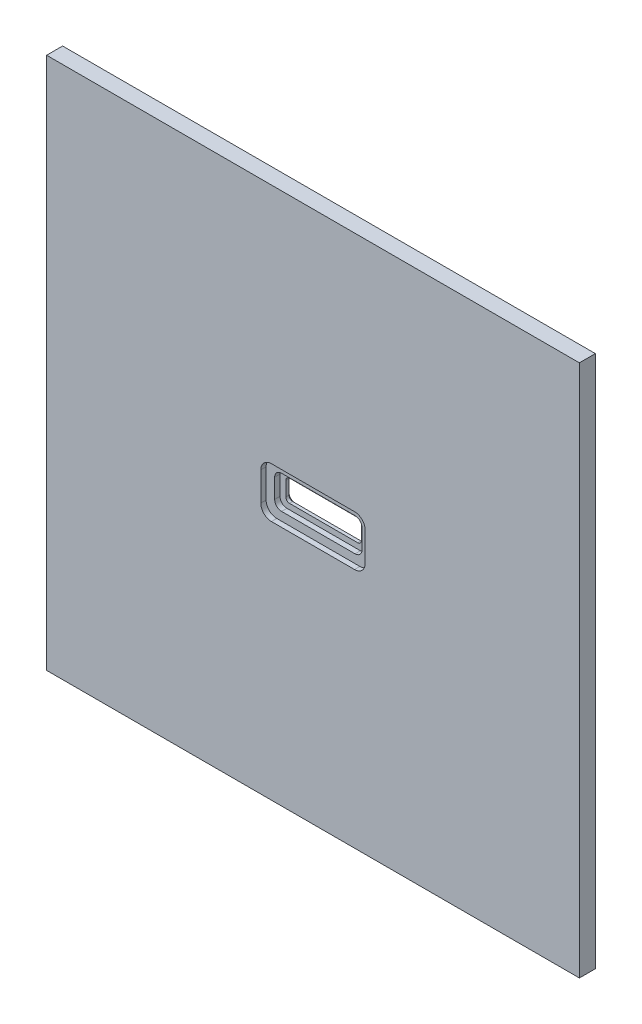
ISO-10303-21;
HEADER;
FILE_DESCRIPTION(('STEP AP214'),'2;1');
FILE_NAME('part.step','',(''),(''),'','','');
FILE_SCHEMA(('AUTOMOTIVE_DESIGN { 1 0 10303 214 1 1 1 1 }'));
ENDSEC;
DATA;
#1=APPLICATION_CONTEXT('core data for automotive mechanical design processes');
#2=APPLICATION_PROTOCOL_DEFINITION('international standard','automotive_design',2000,#1);
#3=PRODUCT_CONTEXT('',#1,'mechanical');
#4=PRODUCT('Part','Part','',(#3));
#5=PRODUCT_RELATED_PRODUCT_CATEGORY('part','',(#4));
#6=PRODUCT_DEFINITION_FORMATION('','',#4);
#7=PRODUCT_DEFINITION_CONTEXT('part definition',#1,'design');
#8=PRODUCT_DEFINITION('design','',#6,#7);
#9=PRODUCT_DEFINITION_SHAPE('','',#8);
#10=(LENGTH_UNIT() NAMED_UNIT(*) SI_UNIT(.MILLI.,.METRE.));
#11=(NAMED_UNIT(*) PLANE_ANGLE_UNIT() SI_UNIT($,.RADIAN.));
#12=(NAMED_UNIT(*) SI_UNIT($,.STERADIAN.) SOLID_ANGLE_UNIT());
#13=UNCERTAINTY_MEASURE_WITH_UNIT(LENGTH_MEASURE(1.E-05),#10,'distance_accuracy_value','');
#14=(GEOMETRIC_REPRESENTATION_CONTEXT(3) GLOBAL_UNCERTAINTY_ASSIGNED_CONTEXT((#13)) GLOBAL_UNIT_ASSIGNED_CONTEXT((#10,
#11,#12)) REPRESENTATION_CONTEXT('',''));
#15=CARTESIAN_POINT('',(0.,0.,0.));
#16=DIRECTION('',(0.,0.,1.));
#17=DIRECTION('',(1.,0.,0.));
#18=AXIS2_PLACEMENT_3D('',#15,#16,#17);
#19=CARTESIAN_POINT('',(0.,0.,1.5));
#20=DIRECTION('',(0.,0.,-1.));
#21=DIRECTION('',(-1.,0.,0.));
#22=AXIS2_PLACEMENT_3D('',#19,#20,#21);
#23=PLANE('',#22);
#24=DIRECTION('',(0.,1.,0.));
#25=VECTOR('',#24,1.);
#26=CARTESIAN_POINT('',(25.,-25.,1.5));
#27=LINE('',#26,#25);
#28=CARTESIAN_POINT('',(25.,-25.,1.5));
#29=VERTEX_POINT('',#28);
#30=CARTESIAN_POINT('',(25.,25.,1.5));
#31=VERTEX_POINT('',#30);
#32=EDGE_CURVE('E495',#29,#31,#27,.T.);
#33=ORIENTED_EDGE('',*,*,#32,.T.);
#34=DIRECTION('',(-1.,0.,0.));
#35=VECTOR('',#34,1.);
#36=CARTESIAN_POINT('',(-25.,25.,1.5));
#37=LINE('',#36,#35);
#38=CARTESIAN_POINT('',(-25.,25.,1.5));
#39=VERTEX_POINT('',#38);
#40=EDGE_CURVE('E499',#31,#39,#37,.T.);
#41=ORIENTED_EDGE('',*,*,#40,.T.);
#42=DIRECTION('',(0.,-1.,0.));
#43=VECTOR('',#42,1.);
#44=CARTESIAN_POINT('',(-25.,-25.,1.5));
#45=LINE('',#44,#43);
#46=CARTESIAN_POINT('',(-25.,-25.,1.5));
#47=VERTEX_POINT('',#46);
#48=EDGE_CURVE('E503',#39,#47,#45,.T.);
#49=ORIENTED_EDGE('',*,*,#48,.T.);
#50=DIRECTION('',(1.,0.,0.));
#51=VECTOR('',#50,1.);
#52=CARTESIAN_POINT('',(-25.,-25.,1.5));
#53=LINE('',#52,#51);
#54=EDGE_CURVE('E506',#47,#29,#53,.T.);
#55=ORIENTED_EDGE('',*,*,#54,.T.);
#56=EDGE_LOOP('',(#33,#41,#49,#55));
#57=FACE_BOUND('',#56,.T.);
#58=CARTESIAN_POINT('',(-3.9,1.35,1.5));
#59=DIRECTION('',(0.,0.,1.));
#60=DIRECTION('',(1.,0.,0.));
#61=AXIS2_PLACEMENT_3D('',#58,#59,#60);
#62=CIRCLE('',#61,1.);
#63=CARTESIAN_POINT('',(-4.9,1.34999999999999,1.5));
#64=VERTEX_POINT('',#63);
#65=CARTESIAN_POINT('',(-3.89999999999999,2.35,1.5));
#66=VERTEX_POINT('',#65);
#67=EDGE_CURVE('E273',#64,#66,#62,.F.);
#68=ORIENTED_EDGE('',*,*,#67,.T.);
#69=DIRECTION('',(1.,0.,0.));
#70=VECTOR('',#69,1.);
#71=CARTESIAN_POINT('',(0.,2.35,1.5));
#72=LINE('',#71,#70);
#73=CARTESIAN_POINT('',(3.89999999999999,2.35,1.5));
#74=VERTEX_POINT('',#73);
#75=EDGE_CURVE('E282',#66,#74,#72,.T.);
#76=ORIENTED_EDGE('',*,*,#75,.T.);
#77=CARTESIAN_POINT('',(3.9,1.35,1.5));
#78=DIRECTION('',(0.,0.,1.));
#79=DIRECTION('',(1.,0.,0.));
#80=AXIS2_PLACEMENT_3D('',#77,#78,#79);
#81=CIRCLE('',#80,1.);
#82=CARTESIAN_POINT('',(4.9,1.34999999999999,1.5));
#83=VERTEX_POINT('',#82);
#84=EDGE_CURVE('E286',#74,#83,#81,.F.);
#85=ORIENTED_EDGE('',*,*,#84,.T.);
#86=DIRECTION('',(0.,1.,0.));
#87=VECTOR('',#86,1.);
#88=CARTESIAN_POINT('',(4.9,0.,1.5));
#89=LINE('',#88,#87);
#90=CARTESIAN_POINT('',(4.9,-1.34999999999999,1.5));
#91=VERTEX_POINT('',#90);
#92=EDGE_CURVE('E351',#91,#83,#89,.T.);
#93=ORIENTED_EDGE('',*,*,#92,.F.);
#94=CARTESIAN_POINT('',(3.9,-1.35,1.5));
#95=DIRECTION('',(0.,0.,1.));
#96=DIRECTION('',(1.,0.,0.));
#97=AXIS2_PLACEMENT_3D('',#94,#95,#96);
#98=CIRCLE('',#97,1.);
#99=CARTESIAN_POINT('',(3.89999999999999,-2.35,1.5));
#100=VERTEX_POINT('',#99);
#101=EDGE_CURVE('E347',#100,#91,#98,.T.);
#102=ORIENTED_EDGE('',*,*,#101,.F.);
#103=DIRECTION('',(1.,0.,0.));
#104=VECTOR('',#103,1.);
#105=CARTESIAN_POINT('',(0.,-2.35,1.5));
#106=LINE('',#105,#104);
#107=CARTESIAN_POINT('',(-3.89999999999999,-2.35,1.5));
#108=VERTEX_POINT('',#107);
#109=EDGE_CURVE('E343',#108,#100,#106,.T.);
#110=ORIENTED_EDGE('',*,*,#109,.F.);
#111=CARTESIAN_POINT('',(-3.9,-1.35,1.5));
#112=DIRECTION('',(0.,0.,1.));
#113=DIRECTION('',(1.,0.,0.));
#114=AXIS2_PLACEMENT_3D('',#111,#112,#113);
#115=CIRCLE('',#114,1.);
#116=CARTESIAN_POINT('',(-4.9,-1.34999999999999,1.5));
#117=VERTEX_POINT('',#116);
#118=EDGE_CURVE('E339',#108,#117,#115,.F.);
#119=ORIENTED_EDGE('',*,*,#118,.T.);
#120=DIRECTION('',(0.,1.,0.));
#121=VECTOR('',#120,1.);
#122=CARTESIAN_POINT('',(-4.9,0.,1.5));
#123=LINE('',#122,#121);
#124=EDGE_CURVE('E336',#117,#64,#123,.T.);
#125=ORIENTED_EDGE('',*,*,#124,.T.);
#126=EDGE_LOOP('',(#68,#76,#85,#93,#102,#110,#119,#125));
#127=FACE_BOUND('',#126,.T.);
#128=ADVANCED_FACE('F40',(#57,#127),#23,.F.);
#129=CARTESIAN_POINT('',(-3.45,0.9,0.5));
#130=DIRECTION('',(0.,0.,1.));
#131=DIRECTION('',(1.,0.,0.));
#132=AXIS2_PLACEMENT_3D('',#129,#130,#131);
#133=CYLINDRICAL_SURFACE('',#132,0.65);
#134=DIRECTION('',(0.,0.,1.));
#135=VECTOR('',#134,1.);
#136=CARTESIAN_POINT('',(-3.44999999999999,1.55,0.5));
#137=LINE('',#136,#135);
#138=CARTESIAN_POINT('',(-3.44999999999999,1.55,0.5));
#139=VERTEX_POINT('',#138);
#140=CARTESIAN_POINT('',(-3.44999999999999,1.55,1.));
#141=VERTEX_POINT('',#140);
#142=EDGE_CURVE('E439',#139,#141,#137,.T.);
#143=ORIENTED_EDGE('',*,*,#142,.T.);
#144=CARTESIAN_POINT('',(-3.45,0.9,1.));
#145=DIRECTION('',(0.,0.,1.));
#146=DIRECTION('',(1.,0.,0.));
#147=AXIS2_PLACEMENT_3D('',#144,#145,#146);
#148=CIRCLE('',#147,0.65);
#149=CARTESIAN_POINT('',(-4.1,0.899999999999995,1.));
#150=VERTEX_POINT('',#149);
#151=EDGE_CURVE('E311',#150,#141,#148,.F.);
#152=ORIENTED_EDGE('',*,*,#151,.F.);
#153=DIRECTION('',(0.,0.,1.));
#154=VECTOR('',#153,1.);
#155=CARTESIAN_POINT('',(-4.1,0.899999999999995,0.5));
#156=LINE('',#155,#154);
#157=CARTESIAN_POINT('',(-4.1,0.899999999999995,0.5));
#158=VERTEX_POINT('',#157);
#159=EDGE_CURVE('E438',#158,#150,#156,.T.);
#160=ORIENTED_EDGE('',*,*,#159,.F.);
#161=CARTESIAN_POINT('',(-3.45,0.9,0.5));
#162=DIRECTION('',(0.,0.,1.));
#163=DIRECTION('',(1.,0.,0.));
#164=AXIS2_PLACEMENT_3D('',#161,#162,#163);
#165=CIRCLE('',#164,0.65);
#166=EDGE_CURVE('E361',#158,#139,#165,.F.);
#167=ORIENTED_EDGE('',*,*,#166,.T.);
#168=EDGE_LOOP('',(#143,#152,#160,#167));
#169=FACE_BOUND('',#168,.T.);
#170=ADVANCED_FACE('F682',(#169),#133,.F.);
#171=CARTESIAN_POINT('',(0.,1.55,0.5));
#172=DIRECTION('',(0.,-1.,0.));
#173=DIRECTION('',(0.,0.,-1.));
#174=AXIS2_PLACEMENT_3D('',#171,#172,#173);
#175=PLANE('',#174);
#176=DIRECTION('',(0.,0.,1.));
#177=VECTOR('',#176,1.);
#178=CARTESIAN_POINT('',(3.44999999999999,1.55,0.5));
#179=LINE('',#178,#177);
#180=CARTESIAN_POINT('',(3.44999999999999,1.55,0.5));
#181=VERTEX_POINT('',#180);
#182=CARTESIAN_POINT('',(3.44999999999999,1.55,1.));
#183=VERTEX_POINT('',#182);
#184=EDGE_CURVE('E444',#181,#183,#179,.T.);
#185=ORIENTED_EDGE('',*,*,#184,.T.);
#186=DIRECTION('',(1.,0.,0.));
#187=VECTOR('',#186,1.);
#188=CARTESIAN_POINT('',(0.,1.55,1.));
#189=LINE('',#188,#187);
#190=EDGE_CURVE('E314',#141,#183,#189,.T.);
#191=ORIENTED_EDGE('',*,*,#190,.F.);
#192=ORIENTED_EDGE('',*,*,#142,.F.);
#193=DIRECTION('',(1.,0.,0.));
#194=VECTOR('',#193,1.);
#195=CARTESIAN_POINT('',(0.,1.55,0.5));
#196=LINE('',#195,#194);
#197=EDGE_CURVE('E403',#139,#181,#196,.T.);
#198=ORIENTED_EDGE('',*,*,#197,.T.);
#199=EDGE_LOOP('',(#185,#191,#192,#198));
#200=FACE_BOUND('',#199,.T.);
#201=ADVANCED_FACE('F688',(#200),#175,.T.);
#202=CARTESIAN_POINT('',(3.45,0.9,0.5));
#203=DIRECTION('',(0.,0.,1.));
#204=DIRECTION('',(1.,0.,0.));
#205=AXIS2_PLACEMENT_3D('',#202,#203,#204);
#206=CYLINDRICAL_SURFACE('',#205,0.65);
#207=DIRECTION('',(0.,0.,1.));
#208=VECTOR('',#207,1.);
#209=CARTESIAN_POINT('',(4.1,0.899999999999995,0.5));
#210=LINE('',#209,#208);
#211=CARTESIAN_POINT('',(4.1,0.899999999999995,0.5));
#212=VERTEX_POINT('',#211);
#213=CARTESIAN_POINT('',(4.1,0.899999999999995,1.));
#214=VERTEX_POINT('',#213);
#215=EDGE_CURVE('E448',#212,#214,#210,.T.);
#216=ORIENTED_EDGE('',*,*,#215,.T.);
#217=CARTESIAN_POINT('',(3.45,0.9,1.));
#218=DIRECTION('',(0.,0.,1.));
#219=DIRECTION('',(1.,0.,0.));
#220=AXIS2_PLACEMENT_3D('',#217,#218,#219);
#221=CIRCLE('',#220,0.65);
#222=EDGE_CURVE('E317',#183,#214,#221,.F.);
#223=ORIENTED_EDGE('',*,*,#222,.F.);
#224=ORIENTED_EDGE('',*,*,#184,.F.);
#225=CARTESIAN_POINT('',(3.45,0.9,0.5));
#226=DIRECTION('',(0.,0.,1.));
#227=DIRECTION('',(1.,0.,0.));
#228=AXIS2_PLACEMENT_3D('',#225,#226,#227);
#229=CIRCLE('',#228,0.65);
#230=EDGE_CURVE('E400',#181,#212,#229,.F.);
#231=ORIENTED_EDGE('',*,*,#230,.T.);
#232=EDGE_LOOP('',(#216,#223,#224,#231));
#233=FACE_BOUND('',#232,.T.);
#234=ADVANCED_FACE('F785',(#233),#206,.F.);
#235=CARTESIAN_POINT('',(4.1,0.,0.5));
#236=DIRECTION('',(1.,0.,0.));
#237=DIRECTION('',(0.,0.,-1.));
#238=AXIS2_PLACEMENT_3D('',#235,#236,#237);
#239=PLANE('',#238);
#240=DIRECTION('',(0.,1.,0.));
#241=VECTOR('',#240,1.);
#242=CARTESIAN_POINT('',(4.1,0.,1.));
#243=LINE('',#242,#241);
#244=CARTESIAN_POINT('',(4.1,-0.899999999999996,1.));
#245=VERTEX_POINT('',#244);
#246=EDGE_CURVE('E320',#245,#214,#243,.T.);
#247=ORIENTED_EDGE('',*,*,#246,.T.);
#248=ORIENTED_EDGE('',*,*,#215,.F.);
#249=DIRECTION('',(0.,1.,0.));
#250=VECTOR('',#249,1.);
#251=CARTESIAN_POINT('',(4.1,0.,0.5));
#252=LINE('',#251,#250);
#253=CARTESIAN_POINT('',(4.1,-0.899999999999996,0.5));
#254=VERTEX_POINT('',#253);
#255=EDGE_CURVE('E396',#254,#212,#252,.T.);
#256=ORIENTED_EDGE('',*,*,#255,.F.);
#257=DIRECTION('',(0.,0.,1.));
#258=VECTOR('',#257,1.);
#259=CARTESIAN_POINT('',(4.1,-0.899999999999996,0.5));
#260=LINE('',#259,#258);
#261=EDGE_CURVE('E452',#254,#245,#260,.T.);
#262=ORIENTED_EDGE('',*,*,#261,.T.);
#263=EDGE_LOOP('',(#247,#248,#256,#262));
#264=FACE_BOUND('',#263,.T.);
#265=ADVANCED_FACE('F789',(#264),#239,.F.);
#266=CARTESIAN_POINT('',(3.45,-0.9,0.5));
#267=DIRECTION('',(0.,0.,1.));
#268=DIRECTION('',(1.,0.,0.));
#269=AXIS2_PLACEMENT_3D('',#266,#267,#268);
#270=CYLINDRICAL_SURFACE('',#269,0.65);
#271=CARTESIAN_POINT('',(3.45,-0.9,1.));
#272=DIRECTION('',(0.,0.,1.));
#273=DIRECTION('',(1.,0.,0.));
#274=AXIS2_PLACEMENT_3D('',#271,#272,#273);
#275=CIRCLE('',#274,0.65);
#276=CARTESIAN_POINT('',(3.44999999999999,-1.55,1.));
#277=VERTEX_POINT('',#276);
#278=EDGE_CURVE('E324',#277,#245,#275,.T.);
#279=ORIENTED_EDGE('',*,*,#278,.T.);
#280=ORIENTED_EDGE('',*,*,#261,.F.);
#281=CARTESIAN_POINT('',(3.45,-0.9,0.5));
#282=DIRECTION('',(0.,0.,1.));
#283=DIRECTION('',(1.,0.,0.));
#284=AXIS2_PLACEMENT_3D('',#281,#282,#283);
#285=CIRCLE('',#284,0.65);
#286=CARTESIAN_POINT('',(3.44999999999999,-1.55,0.5));
#287=VERTEX_POINT('',#286);
#288=EDGE_CURVE('E392',#287,#254,#285,.T.);
#289=ORIENTED_EDGE('',*,*,#288,.F.);
#290=DIRECTION('',(0.,0.,1.));
#291=VECTOR('',#290,1.);
#292=CARTESIAN_POINT('',(3.44999999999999,-1.55,0.5));
#293=LINE('',#292,#291);
#294=EDGE_CURVE('E456',#287,#277,#293,.T.);
#295=ORIENTED_EDGE('',*,*,#294,.T.);
#296=EDGE_LOOP('',(#279,#280,#289,#295));
#297=FACE_BOUND('',#296,.T.);
#298=ADVANCED_FACE('F793',(#297),#270,.F.);
#299=CARTESIAN_POINT('',(0.,-1.55,0.5));
#300=DIRECTION('',(0.,-1.,0.));
#301=DIRECTION('',(0.,0.,-1.));
#302=AXIS2_PLACEMENT_3D('',#299,#300,#301);
#303=PLANE('',#302);
#304=DIRECTION('',(1.,0.,0.));
#305=VECTOR('',#304,1.);
#306=CARTESIAN_POINT('',(0.,-1.55,1.));
#307=LINE('',#306,#305);
#308=CARTESIAN_POINT('',(-3.44999999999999,-1.55,1.));
#309=VERTEX_POINT('',#308);
#310=EDGE_CURVE('E328',#309,#277,#307,.T.);
#311=ORIENTED_EDGE('',*,*,#310,.T.);
#312=ORIENTED_EDGE('',*,*,#294,.F.);
#313=DIRECTION('',(1.,0.,0.));
#314=VECTOR('',#313,1.);
#315=CARTESIAN_POINT('',(0.,-1.55,0.5));
#316=LINE('',#315,#314);
#317=CARTESIAN_POINT('',(-3.44999999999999,-1.55,0.5));
#318=VERTEX_POINT('',#317);
#319=EDGE_CURVE('E388',#318,#287,#316,.T.);
#320=ORIENTED_EDGE('',*,*,#319,.F.);
#321=DIRECTION('',(0.,0.,1.));
#322=VECTOR('',#321,1.);
#323=CARTESIAN_POINT('',(-3.44999999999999,-1.55,0.5));
#324=LINE('',#323,#322);
#325=EDGE_CURVE('E460',#318,#309,#324,.T.);
#326=ORIENTED_EDGE('',*,*,#325,.T.);
#327=EDGE_LOOP('',(#311,#312,#320,#326));
#328=FACE_BOUND('',#327,.T.);
#329=ADVANCED_FACE('F797',(#328),#303,.F.);
#330=CARTESIAN_POINT('',(-3.45,-0.9,0.5));
#331=DIRECTION('',(0.,0.,1.));
#332=DIRECTION('',(1.,0.,0.));
#333=AXIS2_PLACEMENT_3D('',#330,#331,#332);
#334=CYLINDRICAL_SURFACE('',#333,0.65);
#335=DIRECTION('',(0.,0.,1.));
#336=VECTOR('',#335,1.);
#337=CARTESIAN_POINT('',(-4.1,-0.899999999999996,0.5));
#338=LINE('',#337,#336);
#339=CARTESIAN_POINT('',(-4.1,-0.899999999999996,0.5));
#340=VERTEX_POINT('',#339);
#341=CARTESIAN_POINT('',(-4.1,-0.899999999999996,1.));
#342=VERTEX_POINT('',#341);
#343=EDGE_CURVE('E464',#340,#342,#338,.T.);
#344=ORIENTED_EDGE('',*,*,#343,.T.);
#345=CARTESIAN_POINT('',(-3.45,-0.9,1.));
#346=DIRECTION('',(0.,0.,1.));
#347=DIRECTION('',(1.,0.,0.));
#348=AXIS2_PLACEMENT_3D('',#345,#346,#347);
#349=CIRCLE('',#348,0.65);
#350=EDGE_CURVE('E275',#309,#342,#349,.F.);
#351=ORIENTED_EDGE('',*,*,#350,.F.);
#352=ORIENTED_EDGE('',*,*,#325,.F.);
#353=CARTESIAN_POINT('',(-3.45,-0.9,0.5));
#354=DIRECTION('',(0.,0.,1.));
#355=DIRECTION('',(1.,0.,0.));
#356=AXIS2_PLACEMENT_3D('',#353,#354,#355);
#357=CIRCLE('',#356,0.65);
#358=EDGE_CURVE('E385',#318,#340,#357,.F.);
#359=ORIENTED_EDGE('',*,*,#358,.T.);
#360=EDGE_LOOP('',(#344,#351,#352,#359));
#361=FACE_BOUND('',#360,.T.);
#362=ADVANCED_FACE('F801',(#361),#334,.F.);
#363=CARTESIAN_POINT('',(-4.1,0.,0.5));
#364=DIRECTION('',(1.,0.,0.));
#365=DIRECTION('',(0.,0.,-1.));
#366=AXIS2_PLACEMENT_3D('',#363,#364,#365);
#367=PLANE('',#366);
#368=ORIENTED_EDGE('',*,*,#159,.T.);
#369=DIRECTION('',(0.,1.,0.));
#370=VECTOR('',#369,1.);
#371=CARTESIAN_POINT('',(-4.1,0.,1.));
#372=LINE('',#371,#370);
#373=EDGE_CURVE('E308',#342,#150,#372,.T.);
#374=ORIENTED_EDGE('',*,*,#373,.F.);
#375=ORIENTED_EDGE('',*,*,#343,.F.);
#376=DIRECTION('',(0.,1.,0.));
#377=VECTOR('',#376,1.);
#378=CARTESIAN_POINT('',(-4.1,0.,0.5));
#379=LINE('',#378,#377);
#380=EDGE_CURVE('E382',#340,#158,#379,.T.);
#381=ORIENTED_EDGE('',*,*,#380,.T.);
#382=EDGE_LOOP('',(#368,#374,#375,#381));
#383=FACE_BOUND('',#382,.T.);
#384=ADVANCED_FACE('F805',(#383),#367,.T.);
#385=CARTESIAN_POINT('',(-3.2,0.675,0.));
#386=DIRECTION('',(0.,0.,1.));
#387=DIRECTION('',(1.,0.,0.));
#388=AXIS2_PLACEMENT_3D('',#385,#386,#387);
#389=CYLINDRICAL_SURFACE('',#388,0.35);
#390=DIRECTION('',(0.,0.,1.));
#391=VECTOR('',#390,1.);
#392=CARTESIAN_POINT('',(-3.55,0.674999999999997,0.));
#393=LINE('',#392,#391);
#394=CARTESIAN_POINT('',(-3.55,0.674999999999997,0.199999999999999));
#395=VERTEX_POINT('',#394);
#396=CARTESIAN_POINT('',(-3.55,0.674999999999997,0.5));
#397=VERTEX_POINT('',#396);
#398=EDGE_CURVE('E443',#395,#397,#393,.T.);
#399=ORIENTED_EDGE('',*,*,#398,.F.);
#400=CARTESIAN_POINT('',(-3.2,0.675,0.199999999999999));
#401=DIRECTION('',(0.,0.,-1.));
#402=DIRECTION('',(-1.,0.,0.));
#403=AXIS2_PLACEMENT_3D('',#400,#401,#402);
#404=CIRCLE('',#403,0.35);
#405=CARTESIAN_POINT('',(-3.2,1.025,0.199999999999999));
#406=VERTEX_POINT('',#405);
#407=EDGE_CURVE('E65',#395,#406,#404,.T.);
#408=ORIENTED_EDGE('',*,*,#407,.T.);
#409=DIRECTION('',(0.,0.,1.));
#410=VECTOR('',#409,1.);
#411=CARTESIAN_POINT('',(-3.2,1.025,0.));
#412=LINE('',#411,#410);
#413=CARTESIAN_POINT('',(-3.2,1.025,0.5));
#414=VERTEX_POINT('',#413);
#415=EDGE_CURVE('E471',#406,#414,#412,.T.);
#416=ORIENTED_EDGE('',*,*,#415,.T.);
#417=CARTESIAN_POINT('',(-3.2,0.675,0.5));
#418=DIRECTION('',(0.,0.,1.));
#419=DIRECTION('',(1.,0.,0.));
#420=AXIS2_PLACEMENT_3D('',#417,#418,#419);
#421=CIRCLE('',#420,0.35);
#422=EDGE_CURVE('E410',#397,#414,#421,.F.);
#423=ORIENTED_EDGE('',*,*,#422,.F.);
#424=EDGE_LOOP('',(#399,#408,#416,#423));
#425=FACE_BOUND('',#424,.T.);
#426=ADVANCED_FACE('F694',(#425),#389,.F.);
#427=CARTESIAN_POINT('',(0.,1.025,0.));
#428=DIRECTION('',(0.,-1.,0.));
#429=DIRECTION('',(0.,0.,-1.));
#430=AXIS2_PLACEMENT_3D('',#427,#428,#429);
#431=PLANE('',#430);
#432=ORIENTED_EDGE('',*,*,#415,.F.);
#433=DIRECTION('',(1.,0.,0.));
#434=VECTOR('',#433,1.);
#435=CARTESIAN_POINT('',(0.,1.025,0.199999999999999));
#436=LINE('',#435,#434);
#437=CARTESIAN_POINT('',(3.2,1.025,0.199999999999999));
#438=VERTEX_POINT('',#437);
#439=EDGE_CURVE('E11',#406,#438,#436,.T.);
#440=ORIENTED_EDGE('',*,*,#439,.T.);
#441=DIRECTION('',(0.,0.,1.));
#442=VECTOR('',#441,1.);
#443=CARTESIAN_POINT('',(3.2,1.025,0.));
#444=LINE('',#443,#442);
#445=CARTESIAN_POINT('',(3.2,1.025,0.5));
#446=VERTEX_POINT('',#445);
#447=EDGE_CURVE('E475',#438,#446,#444,.T.);
#448=ORIENTED_EDGE('',*,*,#447,.T.);
#449=DIRECTION('',(1.,0.,0.));
#450=VECTOR('',#449,1.);
#451=CARTESIAN_POINT('',(0.,1.025,0.5));
#452=LINE('',#451,#450);
#453=EDGE_CURVE('E414',#414,#446,#452,.T.);
#454=ORIENTED_EDGE('',*,*,#453,.F.);
#455=EDGE_LOOP('',(#432,#440,#448,#454));
#456=FACE_BOUND('',#455,.T.);
#457=ADVANCED_FACE('F810',(#456),#431,.T.);
#458=CARTESIAN_POINT('',(3.2,0.675,0.));
#459=DIRECTION('',(0.,0.,1.));
#460=DIRECTION('',(1.,0.,0.));
#461=AXIS2_PLACEMENT_3D('',#458,#459,#460);
#462=CYLINDRICAL_SURFACE('',#461,0.35);
#463=ORIENTED_EDGE('',*,*,#447,.F.);
#464=CARTESIAN_POINT('',(3.2,0.675,0.199999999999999));
#465=DIRECTION('',(0.,0.,-1.));
#466=DIRECTION('',(-1.,0.,0.));
#467=AXIS2_PLACEMENT_3D('',#464,#465,#466);
#468=CIRCLE('',#467,0.35);
#469=CARTESIAN_POINT('',(3.55,0.674999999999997,0.199999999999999));
#470=VERTEX_POINT('',#469);
#471=EDGE_CURVE('E51',#438,#470,#468,.T.);
#472=ORIENTED_EDGE('',*,*,#471,.T.);
#473=DIRECTION('',(0.,0.,1.));
#474=VECTOR('',#473,1.);
#475=CARTESIAN_POINT('',(3.55,0.674999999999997,0.));
#476=LINE('',#475,#474);
#477=CARTESIAN_POINT('',(3.55,0.674999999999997,0.5));
#478=VERTEX_POINT('',#477);
#479=EDGE_CURVE('E478',#470,#478,#476,.T.);
#480=ORIENTED_EDGE('',*,*,#479,.T.);
#481=CARTESIAN_POINT('',(3.2,0.675,0.5));
#482=DIRECTION('',(0.,0.,1.));
#483=DIRECTION('',(1.,0.,0.));
#484=AXIS2_PLACEMENT_3D('',#481,#482,#483);
#485=CIRCLE('',#484,0.35);
#486=EDGE_CURVE('E418',#446,#478,#485,.F.);
#487=ORIENTED_EDGE('',*,*,#486,.F.);
#488=EDGE_LOOP('',(#463,#472,#480,#487));
#489=FACE_BOUND('',#488,.T.);
#490=ADVANCED_FACE('F623',(#489),#462,.F.);
#491=CARTESIAN_POINT('',(3.55,0.,0.));
#492=DIRECTION('',(1.,0.,0.));
#493=DIRECTION('',(0.,0.,-1.));
#494=AXIS2_PLACEMENT_3D('',#491,#492,#493);
#495=PLANE('',#494);
#496=ORIENTED_EDGE('',*,*,#479,.F.);
#497=DIRECTION('',(0.,-1.,0.));
#498=VECTOR('',#497,1.);
#499=CARTESIAN_POINT('',(3.55,-0.674999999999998,0.199999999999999));
#500=LINE('',#499,#498);
#501=CARTESIAN_POINT('',(3.55,-0.674999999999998,0.199999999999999));
#502=VERTEX_POINT('',#501);
#503=EDGE_CURVE('E574',#470,#502,#500,.T.);
#504=ORIENTED_EDGE('',*,*,#503,.T.);
#505=DIRECTION('',(0.,0.,1.));
#506=VECTOR('',#505,1.);
#507=CARTESIAN_POINT('',(3.55,-0.674999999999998,0.));
#508=LINE('',#507,#506);
#509=CARTESIAN_POINT('',(3.55,-0.674999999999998,0.5));
#510=VERTEX_POINT('',#509);
#511=EDGE_CURVE('E481',#502,#510,#508,.T.);
#512=ORIENTED_EDGE('',*,*,#511,.T.);
#513=DIRECTION('',(0.,1.,0.));
#514=VECTOR('',#513,1.);
#515=CARTESIAN_POINT('',(3.55,0.,0.5));
#516=LINE('',#515,#514);
#517=EDGE_CURVE('E422',#510,#478,#516,.T.);
#518=ORIENTED_EDGE('',*,*,#517,.T.);
#519=EDGE_LOOP('',(#496,#504,#512,#518));
#520=FACE_BOUND('',#519,.T.);
#521=ADVANCED_FACE('F626',(#520),#495,.F.);
#522=CARTESIAN_POINT('',(3.2,-0.675,0.));
#523=DIRECTION('',(0.,0.,1.));
#524=DIRECTION('',(1.,0.,0.));
#525=AXIS2_PLACEMENT_3D('',#522,#523,#524);
#526=CYLINDRICAL_SURFACE('',#525,0.35);
#527=ORIENTED_EDGE('',*,*,#511,.F.);
#528=CARTESIAN_POINT('',(3.2,-0.675,0.199999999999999));
#529=DIRECTION('',(0.,0.,-1.));
#530=DIRECTION('',(-1.,0.,0.));
#531=AXIS2_PLACEMENT_3D('',#528,#529,#530);
#532=CIRCLE('',#531,0.35);
#533=CARTESIAN_POINT('',(3.2,-1.025,0.199999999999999));
#534=VERTEX_POINT('',#533);
#535=EDGE_CURVE('E568',#502,#534,#532,.T.);
#536=ORIENTED_EDGE('',*,*,#535,.T.);
#537=DIRECTION('',(0.,0.,1.));
#538=VECTOR('',#537,1.);
#539=CARTESIAN_POINT('',(3.2,-1.025,0.));
#540=LINE('',#539,#538);
#541=CARTESIAN_POINT('',(3.2,-1.025,0.5));
#542=VERTEX_POINT('',#541);
#543=EDGE_CURVE('E484',#534,#542,#540,.T.);
#544=ORIENTED_EDGE('',*,*,#543,.T.);
#545=CARTESIAN_POINT('',(3.2,-0.675,0.5));
#546=DIRECTION('',(0.,0.,1.));
#547=DIRECTION('',(1.,0.,0.));
#548=AXIS2_PLACEMENT_3D('',#545,#546,#547);
#549=CIRCLE('',#548,0.35);
#550=EDGE_CURVE('E426',#542,#510,#549,.T.);
#551=ORIENTED_EDGE('',*,*,#550,.T.);
#552=EDGE_LOOP('',(#527,#536,#544,#551));
#553=FACE_BOUND('',#552,.T.);
#554=ADVANCED_FACE('F634',(#553),#526,.F.);
#555=CARTESIAN_POINT('',(0.,-1.025,0.));
#556=DIRECTION('',(0.,-1.,0.));
#557=DIRECTION('',(0.,0.,-1.));
#558=AXIS2_PLACEMENT_3D('',#555,#556,#557);
#559=PLANE('',#558);
#560=ORIENTED_EDGE('',*,*,#543,.F.);
#561=DIRECTION('',(-1.,0.,0.));
#562=VECTOR('',#561,1.);
#563=CARTESIAN_POINT('',(-3.2,-1.025,0.199999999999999));
#564=LINE('',#563,#562);
#565=CARTESIAN_POINT('',(-3.2,-1.025,0.199999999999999));
#566=VERTEX_POINT('',#565);
#567=EDGE_CURVE('E561',#534,#566,#564,.T.);
#568=ORIENTED_EDGE('',*,*,#567,.T.);
#569=DIRECTION('',(0.,0.,1.));
#570=VECTOR('',#569,1.);
#571=CARTESIAN_POINT('',(-3.2,-1.025,0.));
#572=LINE('',#571,#570);
#573=CARTESIAN_POINT('',(-3.2,-1.025,0.5));
#574=VERTEX_POINT('',#573);
#575=EDGE_CURVE('E487',#566,#574,#572,.T.);
#576=ORIENTED_EDGE('',*,*,#575,.T.);
#577=DIRECTION('',(1.,0.,0.));
#578=VECTOR('',#577,1.);
#579=CARTESIAN_POINT('',(0.,-1.025,0.5));
#580=LINE('',#579,#578);
#581=EDGE_CURVE('E430',#574,#542,#580,.T.);
#582=ORIENTED_EDGE('',*,*,#581,.T.);
#583=EDGE_LOOP('',(#560,#568,#576,#582));
#584=FACE_BOUND('',#583,.T.);
#585=ADVANCED_FACE('F640',(#584),#559,.F.);
#586=CARTESIAN_POINT('',(-3.2,-0.675,0.));
#587=DIRECTION('',(0.,0.,1.));
#588=DIRECTION('',(1.,0.,0.));
#589=AXIS2_PLACEMENT_3D('',#586,#587,#588);
#590=CYLINDRICAL_SURFACE('',#589,0.35);
#591=ORIENTED_EDGE('',*,*,#575,.F.);
#592=CARTESIAN_POINT('',(-3.2,-0.675,0.199999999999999));
#593=DIRECTION('',(0.,0.,-1.));
#594=DIRECTION('',(-1.,0.,0.));
#595=AXIS2_PLACEMENT_3D('',#592,#593,#594);
#596=CIRCLE('',#595,0.35);
#597=CARTESIAN_POINT('',(-3.55,-0.674999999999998,0.199999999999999));
#598=VERTEX_POINT('',#597);
#599=EDGE_CURVE('E565',#566,#598,#596,.T.);
#600=ORIENTED_EDGE('',*,*,#599,.T.);
#601=DIRECTION('',(0.,0.,1.));
#602=VECTOR('',#601,1.);
#603=CARTESIAN_POINT('',(-3.55,-0.674999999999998,0.));
#604=LINE('',#603,#602);
#605=CARTESIAN_POINT('',(-3.55,-0.674999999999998,0.5));
#606=VERTEX_POINT('',#605);
#607=EDGE_CURVE('E490',#598,#606,#604,.T.);
#608=ORIENTED_EDGE('',*,*,#607,.T.);
#609=CARTESIAN_POINT('',(-3.2,-0.675,0.5));
#610=DIRECTION('',(0.,0.,1.));
#611=DIRECTION('',(1.,0.,0.));
#612=AXIS2_PLACEMENT_3D('',#609,#610,#611);
#613=CIRCLE('',#612,0.35);
#614=EDGE_CURVE('E434',#574,#606,#613,.F.);
#615=ORIENTED_EDGE('',*,*,#614,.F.);
#616=EDGE_LOOP('',(#591,#600,#608,#615));
#617=FACE_BOUND('',#616,.T.);
#618=ADVANCED_FACE('F662',(#617),#590,.F.);
#619=CARTESIAN_POINT('',(-3.55,0.,0.));
#620=DIRECTION('',(1.,0.,0.));
#621=DIRECTION('',(0.,0.,-1.));
#622=AXIS2_PLACEMENT_3D('',#619,#620,#621);
#623=PLANE('',#622);
#624=ORIENTED_EDGE('',*,*,#607,.F.);
#625=DIRECTION('',(0.,1.,0.));
#626=VECTOR('',#625,1.);
#627=CARTESIAN_POINT('',(-3.55,0.,0.199999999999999));
#628=LINE('',#627,#626);
#629=EDGE_CURVE('E571',#598,#395,#628,.T.);
#630=ORIENTED_EDGE('',*,*,#629,.T.);
#631=ORIENTED_EDGE('',*,*,#398,.T.);
#632=DIRECTION('',(0.,1.,0.));
#633=VECTOR('',#632,1.);
#634=CARTESIAN_POINT('',(-3.55,0.,0.5));
#635=LINE('',#634,#633);
#636=EDGE_CURVE('E406',#606,#397,#635,.T.);
#637=ORIENTED_EDGE('',*,*,#636,.F.);
#638=EDGE_LOOP('',(#624,#630,#631,#637));
#639=FACE_BOUND('',#638,.T.);
#640=ADVANCED_FACE('F667',(#639),#623,.T.);
#641=CARTESIAN_POINT('',(0.,0.,0.));
#642=DIRECTION('',(0.,0.,-1.));
#643=DIRECTION('',(-1.,0.,0.));
#644=AXIS2_PLACEMENT_3D('',#641,#642,#643);
#645=PLANE('',#644);
#646=CARTESIAN_POINT('',(-3.2,-0.675,0.));
#647=DIRECTION('',(0.,0.,-1.));
#648=DIRECTION('',(-1.,0.,0.));
#649=AXIS2_PLACEMENT_3D('',#646,#647,#648);
#650=CIRCLE('',#649,0.549999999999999);
#651=CARTESIAN_POINT('',(-3.75,-0.674999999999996,0.));
#652=VERTEX_POINT('',#651);
#653=CARTESIAN_POINT('',(-3.2,-1.225,0.));
#654=VERTEX_POINT('',#653);
#655=EDGE_CURVE('E554',#652,#654,#650,.F.);
#656=ORIENTED_EDGE('',*,*,#655,.T.);
#657=DIRECTION('',(1.,0.,0.));
#658=VECTOR('',#657,1.);
#659=CARTESIAN_POINT('',(3.2,-1.225,0.));
#660=LINE('',#659,#658);
#661=CARTESIAN_POINT('',(3.2,-1.225,0.));
#662=VERTEX_POINT('',#661);
#663=EDGE_CURVE('E557',#654,#662,#660,.T.);
#664=ORIENTED_EDGE('',*,*,#663,.T.);
#665=CARTESIAN_POINT('',(3.2,-0.675,0.));
#666=DIRECTION('',(0.,0.,-1.));
#667=DIRECTION('',(-1.,0.,0.));
#668=AXIS2_PLACEMENT_3D('',#665,#666,#667);
#669=CIRCLE('',#668,0.549999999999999);
#670=CARTESIAN_POINT('',(3.75,-0.674999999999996,0.));
#671=VERTEX_POINT('',#670);
#672=EDGE_CURVE('E551',#662,#671,#669,.F.);
#673=ORIENTED_EDGE('',*,*,#672,.T.);
#674=DIRECTION('',(0.,1.,0.));
#675=VECTOR('',#674,1.);
#676=CARTESIAN_POINT('',(3.75,0.674999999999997,0.));
#677=LINE('',#676,#675);
#678=CARTESIAN_POINT('',(3.75,0.674999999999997,0.));
#679=VERTEX_POINT('',#678);
#680=EDGE_CURVE('E545',#671,#679,#677,.T.);
#681=ORIENTED_EDGE('',*,*,#680,.T.);
#682=CARTESIAN_POINT('',(3.2,0.675,0.));
#683=DIRECTION('',(0.,0.,-1.));
#684=DIRECTION('',(-1.,0.,0.));
#685=AXIS2_PLACEMENT_3D('',#682,#683,#684);
#686=CIRCLE('',#685,0.549999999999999);
#687=CARTESIAN_POINT('',(3.19999999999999,1.225,0.));
#688=VERTEX_POINT('',#687);
#689=EDGE_CURVE('E539',#679,#688,#686,.F.);
#690=ORIENTED_EDGE('',*,*,#689,.T.);
#691=DIRECTION('',(-1.,0.,0.));
#692=VECTOR('',#691,1.);
#693=CARTESIAN_POINT('',(0.,1.225,0.));
#694=LINE('',#693,#692);
#695=CARTESIAN_POINT('',(-3.2,1.225,0.));
#696=VERTEX_POINT('',#695);
#697=EDGE_CURVE('E536',#688,#696,#694,.T.);
#698=ORIENTED_EDGE('',*,*,#697,.T.);
#699=CARTESIAN_POINT('',(-3.2,0.675,0.));
#700=DIRECTION('',(0.,0.,-1.));
#701=DIRECTION('',(-1.,0.,0.));
#702=AXIS2_PLACEMENT_3D('',#699,#700,#701);
#703=CIRCLE('',#702,0.549999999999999);
#704=CARTESIAN_POINT('',(-3.75,0.674999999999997,0.));
#705=VERTEX_POINT('',#704);
#706=EDGE_CURVE('E542',#696,#705,#703,.F.);
#707=ORIENTED_EDGE('',*,*,#706,.T.);
#708=DIRECTION('',(0.,-1.,0.));
#709=VECTOR('',#708,1.);
#710=CARTESIAN_POINT('',(-3.75,0.,0.));
#711=LINE('',#710,#709);
#712=EDGE_CURVE('E548',#705,#652,#711,.T.);
#713=ORIENTED_EDGE('',*,*,#712,.T.);
#714=EDGE_LOOP('',(#656,#664,#673,#681,#690,#698,#707,#713));
#715=FACE_BOUND('',#714,.T.);
#716=DIRECTION('',(0.,1.,0.));
#717=VECTOR('',#716,1.);
#718=CARTESIAN_POINT('',(25.,-25.,0.));
#719=LINE('',#718,#717);
#720=CARTESIAN_POINT('',(25.,-25.,0.));
#721=VERTEX_POINT('',#720);
#722=CARTESIAN_POINT('',(25.,25.,0.));
#723=VERTEX_POINT('',#722);
#724=EDGE_CURVE('E474',#721,#723,#719,.T.);
#725=ORIENTED_EDGE('',*,*,#724,.F.);
#726=DIRECTION('',(1.,0.,0.));
#727=VECTOR('',#726,1.);
#728=CARTESIAN_POINT('',(-25.,-25.,0.));
#729=LINE('',#728,#727);
#730=CARTESIAN_POINT('',(-25.,-25.,0.));
#731=VERTEX_POINT('',#730);
#732=EDGE_CURVE('E500',#731,#721,#729,.T.);
#733=ORIENTED_EDGE('',*,*,#732,.F.);
#734=DIRECTION('',(0.,-1.,0.));
#735=VECTOR('',#734,1.);
#736=CARTESIAN_POINT('',(-25.,-25.,0.));
#737=LINE('',#736,#735);
#738=CARTESIAN_POINT('',(-25.,25.,0.));
#739=VERTEX_POINT('',#738);
#740=EDGE_CURVE('E516',#739,#731,#737,.T.);
#741=ORIENTED_EDGE('',*,*,#740,.F.);
#742=DIRECTION('',(-1.,0.,0.));
#743=VECTOR('',#742,1.);
#744=CARTESIAN_POINT('',(-25.,25.,0.));
#745=LINE('',#744,#743);
#746=EDGE_CURVE('E513',#723,#739,#745,.T.);
#747=ORIENTED_EDGE('',*,*,#746,.F.);
#748=EDGE_LOOP('',(#725,#733,#741,#747));
#749=FACE_BOUND('',#748,.T.);
#750=ADVANCED_FACE('F653',(#715,#749),#645,.T.);
#751=CARTESIAN_POINT('',(25.,-25.,1.5));
#752=DIRECTION('',(-1.,0.,0.));
#753=DIRECTION('',(0.,0.,1.));
#754=AXIS2_PLACEMENT_3D('',#751,#752,#753);
#755=PLANE('',#754);
#756=ORIENTED_EDGE('',*,*,#724,.T.);
#757=DIRECTION('',(0.,0.,-1.));
#758=VECTOR('',#757,1.);
#759=CARTESIAN_POINT('',(25.,25.,1.5));
#760=LINE('',#759,#758);
#761=EDGE_CURVE('E532',#31,#723,#760,.T.);
#762=ORIENTED_EDGE('',*,*,#761,.F.);
#763=ORIENTED_EDGE('',*,*,#32,.F.);
#764=DIRECTION('',(0.,0.,-1.));
#765=VECTOR('',#764,1.);
#766=CARTESIAN_POINT('',(25.,-25.,1.5));
#767=LINE('',#766,#765);
#768=EDGE_CURVE('E509',#29,#721,#767,.T.);
#769=ORIENTED_EDGE('',*,*,#768,.T.);
#770=EDGE_LOOP('',(#756,#762,#763,#769));
#771=FACE_BOUND('',#770,.T.);
#772=ADVANCED_FACE('F698',(#771),#755,.F.);
#773=CARTESIAN_POINT('',(-25.,25.,1.5));
#774=DIRECTION('',(0.,-1.,0.));
#775=DIRECTION('',(0.,0.,-1.));
#776=AXIS2_PLACEMENT_3D('',#773,#774,#775);
#777=PLANE('',#776);
#778=ORIENTED_EDGE('',*,*,#746,.T.);
#779=DIRECTION('',(0.,0.,-1.));
#780=VECTOR('',#779,1.);
#781=CARTESIAN_POINT('',(-25.,25.,1.5));
#782=LINE('',#781,#780);
#783=EDGE_CURVE('E528',#39,#739,#782,.T.);
#784=ORIENTED_EDGE('',*,*,#783,.F.);
#785=ORIENTED_EDGE('',*,*,#40,.F.);
#786=ORIENTED_EDGE('',*,*,#761,.T.);
#787=EDGE_LOOP('',(#778,#784,#785,#786));
#788=FACE_BOUND('',#787,.T.);
#789=ADVANCED_FACE('F706',(#788),#777,.F.);
#790=CARTESIAN_POINT('',(-25.,-25.,1.5));
#791=DIRECTION('',(1.,0.,0.));
#792=DIRECTION('',(0.,0.,-1.));
#793=AXIS2_PLACEMENT_3D('',#790,#791,#792);
#794=PLANE('',#793);
#795=ORIENTED_EDGE('',*,*,#740,.T.);
#796=DIRECTION('',(0.,0.,-1.));
#797=VECTOR('',#796,1.);
#798=CARTESIAN_POINT('',(-25.,-25.,1.5));
#799=LINE('',#798,#797);
#800=EDGE_CURVE('E524',#47,#731,#799,.T.);
#801=ORIENTED_EDGE('',*,*,#800,.F.);
#802=ORIENTED_EDGE('',*,*,#48,.F.);
#803=ORIENTED_EDGE('',*,*,#783,.T.);
#804=EDGE_LOOP('',(#795,#801,#802,#803));
#805=FACE_BOUND('',#804,.T.);
#806=ADVANCED_FACE('F702',(#805),#794,.F.);
#807=CARTESIAN_POINT('',(-25.,-25.,1.5));
#808=DIRECTION('',(0.,1.,0.));
#809=DIRECTION('',(0.,0.,1.));
#810=AXIS2_PLACEMENT_3D('',#807,#808,#809);
#811=PLANE('',#810);
#812=ORIENTED_EDGE('',*,*,#732,.T.);
#813=ORIENTED_EDGE('',*,*,#768,.F.);
#814=ORIENTED_EDGE('',*,*,#54,.F.);
#815=ORIENTED_EDGE('',*,*,#800,.T.);
#816=EDGE_LOOP('',(#812,#813,#814,#815));
#817=FACE_BOUND('',#816,.T.);
#818=ADVANCED_FACE('F699',(#817),#811,.F.);
#819=CARTESIAN_POINT('',(0.,0.,0.5));
#820=DIRECTION('',(0.,0.,1.));
#821=DIRECTION('',(1.,0.,0.));
#822=AXIS2_PLACEMENT_3D('',#819,#820,#821);
#823=PLANE('',#822);
#824=ORIENTED_EDGE('',*,*,#166,.F.);
#825=ORIENTED_EDGE('',*,*,#380,.F.);
#826=ORIENTED_EDGE('',*,*,#358,.F.);
#827=ORIENTED_EDGE('',*,*,#319,.T.);
#828=ORIENTED_EDGE('',*,*,#288,.T.);
#829=ORIENTED_EDGE('',*,*,#255,.T.);
#830=ORIENTED_EDGE('',*,*,#230,.F.);
#831=ORIENTED_EDGE('',*,*,#197,.F.);
#832=EDGE_LOOP('',(#824,#825,#826,#827,#828,#829,#830,#831));
#833=FACE_BOUND('',#832,.T.);
#834=ORIENTED_EDGE('',*,*,#636,.T.);
#835=ORIENTED_EDGE('',*,*,#422,.T.);
#836=ORIENTED_EDGE('',*,*,#453,.T.);
#837=ORIENTED_EDGE('',*,*,#486,.T.);
#838=ORIENTED_EDGE('',*,*,#517,.F.);
#839=ORIENTED_EDGE('',*,*,#550,.F.);
#840=ORIENTED_EDGE('',*,*,#581,.F.);
#841=ORIENTED_EDGE('',*,*,#614,.T.);
#842=EDGE_LOOP('',(#834,#835,#836,#837,#838,#839,#840,#841));
#843=FACE_BOUND('',#842,.T.);
#844=ADVANCED_FACE('F631',(#833,#843),#823,.T.);
#845=CARTESIAN_POINT('',(-3.9,1.35,1.));
#846=DIRECTION('',(0.,0.,1.));
#847=DIRECTION('',(1.,0.,0.));
#848=AXIS2_PLACEMENT_3D('',#845,#846,#847);
#849=CYLINDRICAL_SURFACE('',#848,1.);
#850=ORIENTED_EDGE('',*,*,#67,.F.);
#851=DIRECTION('',(0.,0.,1.));
#852=VECTOR('',#851,1.);
#853=CARTESIAN_POINT('',(-4.9,1.34999999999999,1.));
#854=LINE('',#853,#852);
#855=CARTESIAN_POINT('',(-4.9,1.34999999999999,1.));
#856=VERTEX_POINT('',#855);
#857=EDGE_CURVE('E257',#856,#64,#854,.T.);
#858=ORIENTED_EDGE('',*,*,#857,.F.);
#859=CARTESIAN_POINT('',(-3.9,1.35,1.));
#860=DIRECTION('',(0.,0.,1.));
#861=DIRECTION('',(1.,0.,0.));
#862=AXIS2_PLACEMENT_3D('',#859,#860,#861);
#863=CIRCLE('',#862,1.);
#864=CARTESIAN_POINT('',(-3.89999999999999,2.35,1.));
#865=VERTEX_POINT('',#864);
#866=EDGE_CURVE('E265',#856,#865,#863,.F.);
#867=ORIENTED_EDGE('',*,*,#866,.T.);
#868=DIRECTION('',(0.,0.,1.));
#869=VECTOR('',#868,1.);
#870=CARTESIAN_POINT('',(-3.89999999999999,2.35,1.));
#871=LINE('',#870,#869);
#872=EDGE_CURVE('E358',#865,#66,#871,.T.);
#873=ORIENTED_EDGE('',*,*,#872,.T.);
#874=EDGE_LOOP('',(#850,#858,#867,#873));
#875=FACE_BOUND('',#874,.T.);
#876=ADVANCED_FACE('F269',(#875),#849,.F.);
#877=CARTESIAN_POINT('',(0.,2.35,1.));
#878=DIRECTION('',(0.,-1.,0.));
#879=DIRECTION('',(0.,0.,-1.));
#880=AXIS2_PLACEMENT_3D('',#877,#878,#879);
#881=PLANE('',#880);
#882=ORIENTED_EDGE('',*,*,#75,.F.);
#883=ORIENTED_EDGE('',*,*,#872,.F.);
#884=DIRECTION('',(1.,0.,0.));
#885=VECTOR('',#884,1.);
#886=CARTESIAN_POINT('',(0.,2.35,1.));
#887=LINE('',#886,#885);
#888=CARTESIAN_POINT('',(3.89999999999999,2.35,1.));
#889=VERTEX_POINT('',#888);
#890=EDGE_CURVE('E280',#865,#889,#887,.T.);
#891=ORIENTED_EDGE('',*,*,#890,.T.);
#892=DIRECTION('',(0.,0.,1.));
#893=VECTOR('',#892,1.);
#894=CARTESIAN_POINT('',(3.89999999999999,2.35,1.));
#895=LINE('',#894,#893);
#896=EDGE_CURVE('E362',#889,#74,#895,.T.);
#897=ORIENTED_EDGE('',*,*,#896,.T.);
#898=EDGE_LOOP('',(#882,#883,#891,#897));
#899=FACE_BOUND('',#898,.T.);
#900=ADVANCED_FACE('F755',(#899),#881,.T.);
#901=CARTESIAN_POINT('',(3.9,1.35,1.));
#902=DIRECTION('',(0.,0.,1.));
#903=DIRECTION('',(1.,0.,0.));
#904=AXIS2_PLACEMENT_3D('',#901,#902,#903);
#905=CYLINDRICAL_SURFACE('',#904,1.);
#906=ORIENTED_EDGE('',*,*,#84,.F.);
#907=ORIENTED_EDGE('',*,*,#896,.F.);
#908=CARTESIAN_POINT('',(3.9,1.35,1.));
#909=DIRECTION('',(0.,0.,1.));
#910=DIRECTION('',(1.,0.,0.));
#911=AXIS2_PLACEMENT_3D('',#908,#909,#910);
#912=CIRCLE('',#911,1.);
#913=CARTESIAN_POINT('',(4.9,1.34999999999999,1.));
#914=VERTEX_POINT('',#913);
#915=EDGE_CURVE('E303',#889,#914,#912,.F.);
#916=ORIENTED_EDGE('',*,*,#915,.T.);
#917=DIRECTION('',(0.,0.,1.));
#918=VECTOR('',#917,1.);
#919=CARTESIAN_POINT('',(4.9,1.34999999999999,1.));
#920=LINE('',#919,#918);
#921=EDGE_CURVE('E365',#914,#83,#920,.T.);
#922=ORIENTED_EDGE('',*,*,#921,.T.);
#923=EDGE_LOOP('',(#906,#907,#916,#922));
#924=FACE_BOUND('',#923,.T.);
#925=ADVANCED_FACE('F758',(#924),#905,.F.);
#926=CARTESIAN_POINT('',(4.9,0.,1.));
#927=DIRECTION('',(1.,0.,0.));
#928=DIRECTION('',(0.,0.,-1.));
#929=AXIS2_PLACEMENT_3D('',#926,#927,#928);
#930=PLANE('',#929);
#931=ORIENTED_EDGE('',*,*,#92,.T.);
#932=ORIENTED_EDGE('',*,*,#921,.F.);
#933=DIRECTION('',(0.,1.,0.));
#934=VECTOR('',#933,1.);
#935=CARTESIAN_POINT('',(4.9,0.,1.));
#936=LINE('',#935,#934);
#937=CARTESIAN_POINT('',(4.9,-1.34999999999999,1.));
#938=VERTEX_POINT('',#937);
#939=EDGE_CURVE('E299',#938,#914,#936,.T.);
#940=ORIENTED_EDGE('',*,*,#939,.F.);
#941=DIRECTION('',(0.,0.,1.));
#942=VECTOR('',#941,1.);
#943=CARTESIAN_POINT('',(4.9,-1.34999999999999,1.));
#944=LINE('',#943,#942);
#945=EDGE_CURVE('E368',#938,#91,#944,.T.);
#946=ORIENTED_EDGE('',*,*,#945,.T.);
#947=EDGE_LOOP('',(#931,#932,#940,#946));
#948=FACE_BOUND('',#947,.T.);
#949=ADVANCED_FACE('F762',(#948),#930,.F.);
#950=CARTESIAN_POINT('',(3.9,-1.35,1.));
#951=DIRECTION('',(0.,0.,1.));
#952=DIRECTION('',(1.,0.,0.));
#953=AXIS2_PLACEMENT_3D('',#950,#951,#952);
#954=CYLINDRICAL_SURFACE('',#953,1.);
#955=ORIENTED_EDGE('',*,*,#101,.T.);
#956=ORIENTED_EDGE('',*,*,#945,.F.);
#957=CARTESIAN_POINT('',(3.9,-1.35,1.));
#958=DIRECTION('',(0.,0.,1.));
#959=DIRECTION('',(1.,0.,0.));
#960=AXIS2_PLACEMENT_3D('',#957,#958,#959);
#961=CIRCLE('',#960,1.);
#962=CARTESIAN_POINT('',(3.89999999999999,-2.35,1.));
#963=VERTEX_POINT('',#962);
#964=EDGE_CURVE('E295',#963,#938,#961,.T.);
#965=ORIENTED_EDGE('',*,*,#964,.F.);
#966=DIRECTION('',(0.,0.,1.));
#967=VECTOR('',#966,1.);
#968=CARTESIAN_POINT('',(3.89999999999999,-2.35,1.));
#969=LINE('',#968,#967);
#970=EDGE_CURVE('E371',#963,#100,#969,.T.);
#971=ORIENTED_EDGE('',*,*,#970,.T.);
#972=EDGE_LOOP('',(#955,#956,#965,#971));
#973=FACE_BOUND('',#972,.T.);
#974=ADVANCED_FACE('F766',(#973),#954,.F.);
#975=CARTESIAN_POINT('',(0.,-2.35,1.));
#976=DIRECTION('',(0.,-1.,0.));
#977=DIRECTION('',(0.,0.,-1.));
#978=AXIS2_PLACEMENT_3D('',#975,#976,#977);
#979=PLANE('',#978);
#980=ORIENTED_EDGE('',*,*,#109,.T.);
#981=ORIENTED_EDGE('',*,*,#970,.F.);
#982=DIRECTION('',(1.,0.,0.));
#983=VECTOR('',#982,1.);
#984=CARTESIAN_POINT('',(0.,-2.35,1.));
#985=LINE('',#984,#983);
#986=CARTESIAN_POINT('',(-3.89999999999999,-2.35,1.));
#987=VERTEX_POINT('',#986);
#988=EDGE_CURVE('E291',#987,#963,#985,.T.);
#989=ORIENTED_EDGE('',*,*,#988,.F.);
#990=DIRECTION('',(0.,0.,1.));
#991=VECTOR('',#990,1.);
#992=CARTESIAN_POINT('',(-3.89999999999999,-2.35,1.));
#993=LINE('',#992,#991);
#994=EDGE_CURVE('E374',#987,#108,#993,.T.);
#995=ORIENTED_EDGE('',*,*,#994,.T.);
#996=EDGE_LOOP('',(#980,#981,#989,#995));
#997=FACE_BOUND('',#996,.T.);
#998=ADVANCED_FACE('F770',(#997),#979,.F.);
#999=CARTESIAN_POINT('',(-3.9,-1.35,1.));
#1000=DIRECTION('',(0.,0.,1.));
#1001=DIRECTION('',(1.,0.,0.));
#1002=AXIS2_PLACEMENT_3D('',#999,#1000,#1001);
#1003=CYLINDRICAL_SURFACE('',#1002,1.);
#1004=ORIENTED_EDGE('',*,*,#118,.F.);
#1005=ORIENTED_EDGE('',*,*,#994,.F.);
#1006=CARTESIAN_POINT('',(-3.9,-1.35,1.));
#1007=DIRECTION('',(0.,0.,1.));
#1008=DIRECTION('',(1.,0.,0.));
#1009=AXIS2_PLACEMENT_3D('',#1006,#1007,#1008);
#1010=CIRCLE('',#1009,1.);
#1011=CARTESIAN_POINT('',(-4.9,-1.34999999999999,1.));
#1012=VERTEX_POINT('',#1011);
#1013=EDGE_CURVE('E264',#987,#1012,#1010,.F.);
#1014=ORIENTED_EDGE('',*,*,#1013,.T.);
#1015=DIRECTION('',(0.,0.,1.));
#1016=VECTOR('',#1015,1.);
#1017=CARTESIAN_POINT('',(-4.9,-1.34999999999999,1.));
#1018=LINE('',#1017,#1016);
#1019=EDGE_CURVE('E259',#1012,#117,#1018,.T.);
#1020=ORIENTED_EDGE('',*,*,#1019,.T.);
#1021=EDGE_LOOP('',(#1004,#1005,#1014,#1020));
#1022=FACE_BOUND('',#1021,.T.);
#1023=ADVANCED_FACE('F752',(#1022),#1003,.F.);
#1024=CARTESIAN_POINT('',(-4.9,0.,1.));
#1025=DIRECTION('',(1.,0.,0.));
#1026=DIRECTION('',(0.,0.,-1.));
#1027=AXIS2_PLACEMENT_3D('',#1024,#1025,#1026);
#1028=PLANE('',#1027);
#1029=ORIENTED_EDGE('',*,*,#124,.F.);
#1030=ORIENTED_EDGE('',*,*,#1019,.F.);
#1031=DIRECTION('',(0.,1.,0.));
#1032=VECTOR('',#1031,1.);
#1033=CARTESIAN_POINT('',(-4.9,0.,1.));
#1034=LINE('',#1033,#1032);
#1035=EDGE_CURVE('E253',#1012,#856,#1034,.T.);
#1036=ORIENTED_EDGE('',*,*,#1035,.T.);
#1037=ORIENTED_EDGE('',*,*,#857,.T.);
#1038=EDGE_LOOP('',(#1029,#1030,#1036,#1037));
#1039=FACE_BOUND('',#1038,.T.);
#1040=ADVANCED_FACE('F256',(#1039),#1028,.T.);
#1041=CARTESIAN_POINT('',(0.,0.,1.));
#1042=DIRECTION('',(0.,0.,1.));
#1043=DIRECTION('',(1.,0.,0.));
#1044=AXIS2_PLACEMENT_3D('',#1041,#1042,#1043);
#1045=PLANE('',#1044);
#1046=ORIENTED_EDGE('',*,*,#866,.F.);
#1047=ORIENTED_EDGE('',*,*,#1035,.F.);
#1048=ORIENTED_EDGE('',*,*,#1013,.F.);
#1049=ORIENTED_EDGE('',*,*,#988,.T.);
#1050=ORIENTED_EDGE('',*,*,#964,.T.);
#1051=ORIENTED_EDGE('',*,*,#939,.T.);
#1052=ORIENTED_EDGE('',*,*,#915,.F.);
#1053=ORIENTED_EDGE('',*,*,#890,.F.);
#1054=EDGE_LOOP('',(#1046,#1047,#1048,#1049,#1050,#1051,#1052,#1053));
#1055=FACE_BOUND('',#1054,.T.);
#1056=ORIENTED_EDGE('',*,*,#373,.T.);
#1057=ORIENTED_EDGE('',*,*,#151,.T.);
#1058=ORIENTED_EDGE('',*,*,#190,.T.);
#1059=ORIENTED_EDGE('',*,*,#222,.T.);
#1060=ORIENTED_EDGE('',*,*,#246,.F.);
#1061=ORIENTED_EDGE('',*,*,#278,.F.);
#1062=ORIENTED_EDGE('',*,*,#310,.F.);
#1063=ORIENTED_EDGE('',*,*,#350,.T.);
#1064=EDGE_LOOP('',(#1056,#1057,#1058,#1059,#1060,#1061,#1062,#1063));
#1065=FACE_BOUND('',#1064,.T.);
#1066=ADVANCED_FACE('F277',(#1055,#1065),#1045,.T.);
#1067=CARTESIAN_POINT('',(0.,1.025,0.199999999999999));
#1068=DIRECTION('',(0.,0.707106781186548,0.707106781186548));
#1069=DIRECTION('',(1.,0.,0.));
#1070=AXIS2_PLACEMENT_3D('',#1067,#1068,#1069);
#1071=PLANE('',#1070);
#1072=DIRECTION('',(0.,0.707106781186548,-0.707106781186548));
#1073=VECTOR('',#1072,1.);
#1074=CARTESIAN_POINT('',(3.2,1.025,0.199999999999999));
#1075=LINE('',#1074,#1073);
#1076=EDGE_CURVE('E602',#438,#688,#1075,.T.);
#1077=ORIENTED_EDGE('',*,*,#1076,.F.);
#1078=ORIENTED_EDGE('',*,*,#439,.F.);
#1079=DIRECTION('',(0.,-0.707106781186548,0.707106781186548));
#1080=VECTOR('',#1079,1.);
#1081=CARTESIAN_POINT('',(-3.2,1.225,0.));
#1082=LINE('',#1081,#1080);
#1083=EDGE_CURVE('E45',#696,#406,#1082,.T.);
#1084=ORIENTED_EDGE('',*,*,#1083,.F.);
#1085=ORIENTED_EDGE('',*,*,#697,.F.);
#1086=EDGE_LOOP('',(#1077,#1078,#1084,#1085));
#1087=FACE_BOUND('',#1086,.T.);
#1088=ADVANCED_FACE('F43',(#1087),#1071,.F.);
#1089=CARTESIAN_POINT('',(-3.2,0.675,0.199999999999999));
#1090=DIRECTION('',(0.,0.,-1.));
#1091=DIRECTION('',(-1.,0.,0.));
#1092=AXIS2_PLACEMENT_3D('',#1089,#1090,#1091);
#1093=CONICAL_SURFACE('',#1092,0.35,0.785398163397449);
#1094=ORIENTED_EDGE('',*,*,#1083,.T.);
#1095=ORIENTED_EDGE('',*,*,#407,.F.);
#1096=DIRECTION('',(0.707106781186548,0.,0.707106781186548));
#1097=VECTOR('',#1096,1.);
#1098=CARTESIAN_POINT('',(-3.75,0.674999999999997,0.));
#1099=LINE('',#1098,#1097);
#1100=EDGE_CURVE('E599',#705,#395,#1099,.T.);
#1101=ORIENTED_EDGE('',*,*,#1100,.F.);
#1102=ORIENTED_EDGE('',*,*,#706,.F.);
#1103=EDGE_LOOP('',(#1094,#1095,#1101,#1102));
#1104=FACE_BOUND('',#1103,.T.);
#1105=ADVANCED_FACE('F614',(#1104),#1093,.F.);
#1106=CARTESIAN_POINT('',(3.2,0.675,0.199999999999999));
#1107=DIRECTION('',(0.,0.,-1.));
#1108=DIRECTION('',(-1.,0.,0.));
#1109=AXIS2_PLACEMENT_3D('',#1106,#1107,#1108);
#1110=CONICAL_SURFACE('',#1109,0.35,0.785398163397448);
#1111=ORIENTED_EDGE('',*,*,#1076,.T.);
#1112=ORIENTED_EDGE('',*,*,#689,.F.);
#1113=DIRECTION('',(0.707106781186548,0.,-0.707106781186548));
#1114=VECTOR('',#1113,1.);
#1115=CARTESIAN_POINT('',(3.55,0.674999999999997,0.199999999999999));
#1116=LINE('',#1115,#1114);
#1117=EDGE_CURVE('E595',#470,#679,#1116,.T.);
#1118=ORIENTED_EDGE('',*,*,#1117,.F.);
#1119=ORIENTED_EDGE('',*,*,#471,.F.);
#1120=EDGE_LOOP('',(#1111,#1112,#1118,#1119));
#1121=FACE_BOUND('',#1120,.T.);
#1122=ADVANCED_FACE('F619',(#1121),#1110,.F.);
#1123=CARTESIAN_POINT('',(-3.55,0.,0.199999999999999));
#1124=DIRECTION('',(-0.707106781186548,0.,0.707106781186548));
#1125=DIRECTION('',(0.,1.,0.));
#1126=AXIS2_PLACEMENT_3D('',#1123,#1124,#1125);
#1127=PLANE('',#1126);
#1128=ORIENTED_EDGE('',*,*,#1100,.T.);
#1129=ORIENTED_EDGE('',*,*,#629,.F.);
#1130=DIRECTION('',(0.707106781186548,0.,0.707106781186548));
#1131=VECTOR('',#1130,1.);
#1132=CARTESIAN_POINT('',(-3.75,-0.674999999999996,0.));
#1133=LINE('',#1132,#1131);
#1134=EDGE_CURVE('E591',#652,#598,#1133,.T.);
#1135=ORIENTED_EDGE('',*,*,#1134,.F.);
#1136=ORIENTED_EDGE('',*,*,#712,.F.);
#1137=EDGE_LOOP('',(#1128,#1129,#1135,#1136));
#1138=FACE_BOUND('',#1137,.T.);
#1139=ADVANCED_FACE('F669',(#1138),#1127,.F.);
#1140=CARTESIAN_POINT('',(3.75,0.,0.));
#1141=DIRECTION('',(-0.707106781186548,0.,-0.707106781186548));
#1142=DIRECTION('',(0.,-1.,0.));
#1143=AXIS2_PLACEMENT_3D('',#1140,#1141,#1142);
#1144=PLANE('',#1143);
#1145=ORIENTED_EDGE('',*,*,#1117,.T.);
#1146=ORIENTED_EDGE('',*,*,#680,.F.);
#1147=DIRECTION('',(0.707106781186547,0.,-0.707106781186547));
#1148=VECTOR('',#1147,1.);
#1149=CARTESIAN_POINT('',(3.55,-0.674999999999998,0.199999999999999));
#1150=LINE('',#1149,#1148);
#1151=EDGE_CURVE('E587',#502,#671,#1150,.T.);
#1152=ORIENTED_EDGE('',*,*,#1151,.F.);
#1153=ORIENTED_EDGE('',*,*,#503,.F.);
#1154=EDGE_LOOP('',(#1145,#1146,#1152,#1153));
#1155=FACE_BOUND('',#1154,.T.);
#1156=ADVANCED_FACE('F671',(#1155),#1144,.T.);
#1157=CARTESIAN_POINT('',(-3.2,-0.675,0.199999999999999));
#1158=DIRECTION('',(0.,0.,-1.));
#1159=DIRECTION('',(-1.,0.,0.));
#1160=AXIS2_PLACEMENT_3D('',#1157,#1158,#1159);
#1161=CONICAL_SURFACE('',#1160,0.35,0.785398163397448);
#1162=ORIENTED_EDGE('',*,*,#1134,.T.);
#1163=ORIENTED_EDGE('',*,*,#599,.F.);
#1164=DIRECTION('',(0.,0.707106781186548,0.707106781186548));
#1165=VECTOR('',#1164,1.);
#1166=CARTESIAN_POINT('',(-3.2,-1.225,0.));
#1167=LINE('',#1166,#1165);
#1168=EDGE_CURVE('E584',#654,#566,#1167,.T.);
#1169=ORIENTED_EDGE('',*,*,#1168,.F.);
#1170=ORIENTED_EDGE('',*,*,#655,.F.);
#1171=EDGE_LOOP('',(#1162,#1163,#1169,#1170));
#1172=FACE_BOUND('',#1171,.T.);
#1173=ADVANCED_FACE('F659',(#1172),#1161,.F.);
#1174=CARTESIAN_POINT('',(3.2,-0.675,0.));
#1175=DIRECTION('',(0.,0.,-1.));
#1176=DIRECTION('',(-1.,0.,0.));
#1177=AXIS2_PLACEMENT_3D('',#1174,#1175,#1176);
#1178=CONICAL_SURFACE('',#1177,0.549999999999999,0.785398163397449);
#1179=ORIENTED_EDGE('',*,*,#1151,.T.);
#1180=ORIENTED_EDGE('',*,*,#672,.F.);
#1181=DIRECTION('',(0.,-0.707106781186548,-0.707106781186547));
#1182=VECTOR('',#1181,1.);
#1183=CARTESIAN_POINT('',(3.2,-1.025,0.199999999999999));
#1184=LINE('',#1183,#1182);
#1185=EDGE_CURVE('E581',#534,#662,#1184,.T.);
#1186=ORIENTED_EDGE('',*,*,#1185,.F.);
#1187=ORIENTED_EDGE('',*,*,#535,.F.);
#1188=EDGE_LOOP('',(#1179,#1180,#1186,#1187));
#1189=FACE_BOUND('',#1188,.T.);
#1190=ADVANCED_FACE('F650',(#1189),#1178,.F.);
#1191=CARTESIAN_POINT('',(0.,-1.225,0.));
#1192=DIRECTION('',(0.,0.707106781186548,-0.707106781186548));
#1193=DIRECTION('',(-1.,0.,0.));
#1194=AXIS2_PLACEMENT_3D('',#1191,#1192,#1193);
#1195=PLANE('',#1194);
#1196=ORIENTED_EDGE('',*,*,#1168,.T.);
#1197=ORIENTED_EDGE('',*,*,#567,.F.);
#1198=ORIENTED_EDGE('',*,*,#1185,.T.);
#1199=ORIENTED_EDGE('',*,*,#663,.F.);
#1200=EDGE_LOOP('',(#1196,#1197,#1198,#1199));
#1201=FACE_BOUND('',#1200,.T.);
#1202=ADVANCED_FACE('F644',(#1201),#1195,.T.);
#1203=CLOSED_SHELL('',(#128,#170,#201,#234,#265,#298,#329,#362,#384,#426,#457,#490,#521,#554,
#585,#618,#640,#750,#772,#789,#806,#818,#844,#876,#900,#925,#949,#974,#998,#1023,#1040,#1066,
#1088,#1105,#1122,#1139,#1156,#1173,#1190,#1202));
#1204=MANIFOLD_SOLID_BREP('B2',#1203);
#1205=ADVANCED_BREP_SHAPE_REPRESENTATION('',(#18,#1204),#14);
#1206=SHAPE_DEFINITION_REPRESENTATION(#9,#1205);
ENDSEC;
END-ISO-10303-21;
